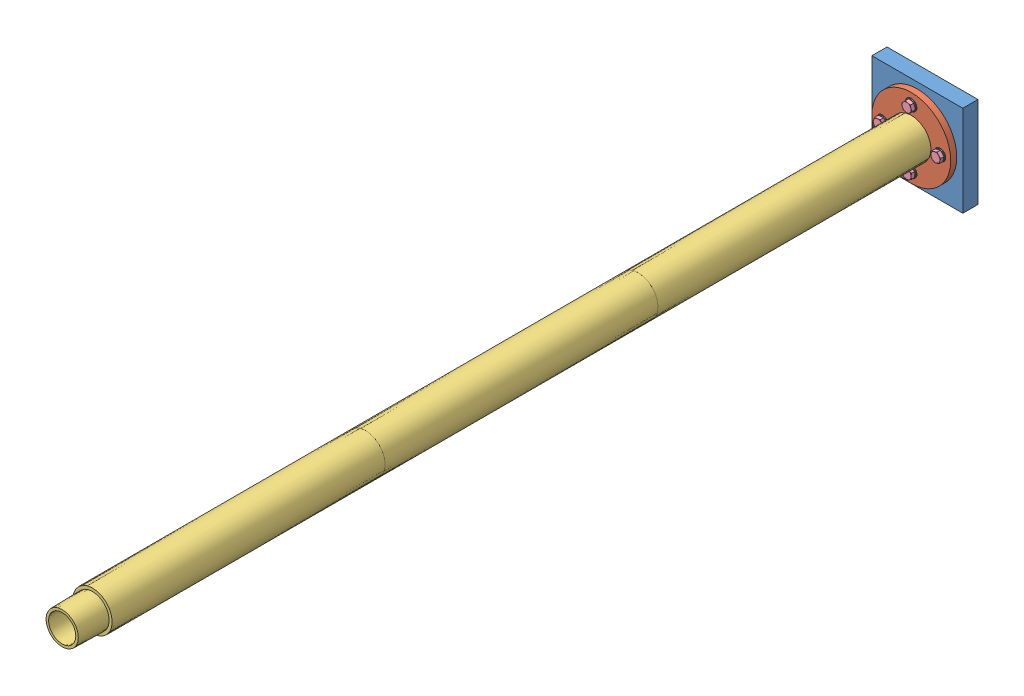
SolidWorks assembly Assemblage base socle pylone.SLDASM, configuration Défaut (file format 3400). Lengths in mm.
Overall size (300 300 2870).
17 component instances, 5 part files, 17 mates.
Components (placement in the parent):
- Base-1: Base.SLDPRT [Défaut] at origin size (300 300 50)
- Socle-1: Socle.SLDPRT [Défaut] at (150 150 50) x (1 0 0) z (0 -1 0) size (260 220 260)
- Pilonne 1000mm-1: Pilonne 1000mm.SLDPRT [Défaut] at (150 150 989.506) x (0.672345 0.740238 0) z (0.740238 -0.672345 0) size (130 1000 130)
- Pilonne 1000mm-2: Pilonne 1000mm.SLDPRT [Défaut] at (150 150 1889.506) x (0.99948 -0.032248 0) z (-0.032248 -0.99948 0) size (130 1000 130)
- Pilonne 1000mm-3: Pilonne 1000mm.SLDPRT [Défaut] at (150 150 2789.506) x (1 0 0) z (0 -1 0) size (130 1000 130)
- Assemblage Vis M20-1: Assemblage Vis M20.SLDASM [Défaut] at (150 55 85.5) x (0 0 -1) z (0.509259 -0.860614 0) size (57.5 37 37)
  - Vis M20 45mm-1: Vis M20 45mm.SLDPRT [ISO 4017 - M20 x 45-N] at origin size (57.5 34.64 30)
  - Rondelle M20-1: Rondelle M20.SLDPRT [Washer ISO 7090 - 20] at (15.5 0 0) size (3 37 37)
- Assemblage Vis M20-2: Assemblage Vis M20.SLDASM [Défaut] at (150 245 85.5) x (0 0 -1) z (-0.237404 -0.971411 0) size (57.5 37 37)
  - Vis M20 45mm-1: Vis M20 45mm.SLDPRT [ISO 4017 - M20 x 45-N] at origin size (57.5 34.64 30)
  - Rondelle M20-1: Rondelle M20.SLDPRT [Washer ISO 7090 - 20] at (15.5 0 0) size (3 37 37)
- Assemblage Vis M20-3: Assemblage Vis M20.SLDASM [Défaut] at (245 150 85.5) x (0 0 -1) z (0.9663 -0.25742 0) size (57.5 37 37)
  - Vis M20 45mm-1: Vis M20 45mm.SLDPRT [ISO 4017 - M20 x 45-N] at origin size (57.5 34.64 30)
  - Rondelle M20-1: Rondelle M20.SLDPRT [Washer ISO 7090 - 20] at (15.5 0 0) size (3 37 37)
- Assemblage Vis M20-4: Assemblage Vis M20.SLDASM [Défaut] at (55 150 85.5) x (0 0 -1) z (-0.82429 -0.566167 0) size (57.5 37 37)
  - Vis M20 45mm-1: Vis M20 45mm.SLDPRT [ISO 4017 - M20 x 45-N] at origin size (57.5 34.64 30)
  - Rondelle M20-1: Rondelle M20.SLDPRT [Washer ISO 7090 - 20] at (15.5 0 0) size (3 37 37)
Mates (geometry in assembly coordinates):
- Coïncidente1: coincident anti-aligned: plane of Base-1 through (0 300 50) normal (0 0 1); plane of ? through (224.9382 242.8575 50) normal (0 0 -1)
- Coaxiale3: concentric anti-aligned: cone of ?; cylinder of ?
- Coïncidente2: coincident anti-aligned: plane of ? through (252.3912 115.7893 70) normal (0 0 1); plane of ? through (261.9172 283.5707 70) normal (0 0 -1)
- Coaxiale4: concentric anti-aligned: cone of ?; cylinder of ?
- Coïncidente3: coincident anti-aligned: plane of ? through (268.6406 290.973 970) normal (0 0 1); plane of ? through (279.9096 241.0839 970) normal (0 0 -1)
- Coaxiale5: concentric anti-aligned: cone of ?; cylinder of ?
- Coïncidente4: coincident anti-aligned: plane of ? through (289.9044 240.7614 1870) normal (0 0 1); plane of ? through (279.9382 242.8575 1870) normal (0 0 -1)
- Coaxiale18: concentric aligned: cylinder of Base-1; cylinder of ?
- Coaxiale19: concentric aligned: unknown of Base-1
- Coaxiale20: concentric aligned: unknown of ?
- Coaxiale21: concentric aligned: unknown of Base-1
- Coaxiale22: concentric aligned: unknown of Base-1
- Coïncidente10: coincident anti-aligned: unknown of ?
- Coïncidente11: coincident anti-aligned: unknown of ?
- Coïncidente12: coincident anti-aligned: unknown of ?
- Coïncidente13: coincident anti-aligned: unknown of ?
- Coaxiale23: concentric aligned: cylinder of ?; cylinder of ?
